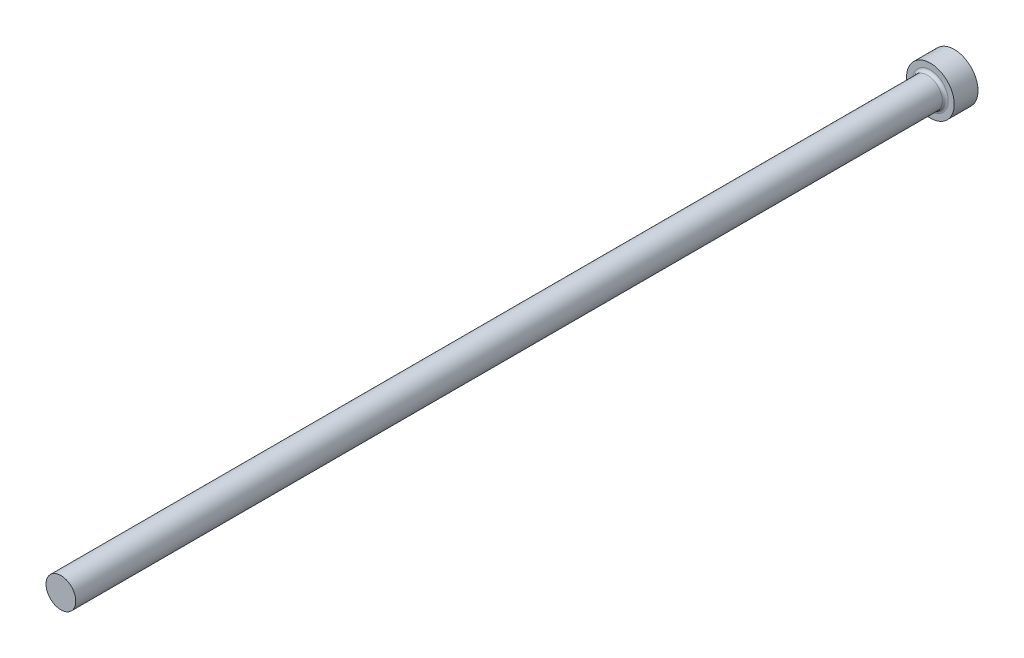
ISO-10303-21;
HEADER;
FILE_DESCRIPTION(('STEP AP214'),'2;1');
FILE_NAME('part.step','',(''),(''),'','','');
FILE_SCHEMA(('AUTOMOTIVE_DESIGN { 1 0 10303 214 1 1 1 1 }'));
ENDSEC;
DATA;
#1=APPLICATION_CONTEXT('core data for automotive mechanical design processes');
#2=APPLICATION_PROTOCOL_DEFINITION('international standard','automotive_design',2000,#1);
#3=PRODUCT_CONTEXT('',#1,'mechanical');
#4=PRODUCT('Part','Part','',(#3));
#5=PRODUCT_RELATED_PRODUCT_CATEGORY('part','',(#4));
#6=PRODUCT_DEFINITION_FORMATION('','',#4);
#7=PRODUCT_DEFINITION_CONTEXT('part definition',#1,'design');
#8=PRODUCT_DEFINITION('design','',#6,#7);
#9=PRODUCT_DEFINITION_SHAPE('','',#8);
#10=(LENGTH_UNIT() NAMED_UNIT(*) SI_UNIT(.MILLI.,.METRE.));
#11=(NAMED_UNIT(*) PLANE_ANGLE_UNIT() SI_UNIT($,.RADIAN.));
#12=(NAMED_UNIT(*) SI_UNIT($,.STERADIAN.) SOLID_ANGLE_UNIT());
#13=UNCERTAINTY_MEASURE_WITH_UNIT(LENGTH_MEASURE(1.E-05),#10,'distance_accuracy_value','');
#14=(GEOMETRIC_REPRESENTATION_CONTEXT(3) GLOBAL_UNCERTAINTY_ASSIGNED_CONTEXT((#13)) GLOBAL_UNIT_ASSIGNED_CONTEXT((#10,
#11,#12)) REPRESENTATION_CONTEXT('',''));
#15=CARTESIAN_POINT('',(0.,0.,0.));
#16=DIRECTION('',(0.,0.,1.));
#17=DIRECTION('',(1.,0.,0.));
#18=AXIS2_PLACEMENT_3D('',#15,#16,#17);
#19=CARTESIAN_POINT('',(4.,0.,4.));
#20=DIRECTION('',(0.,0.,-1.));
#21=DIRECTION('',(-1.,0.,0.));
#22=AXIS2_PLACEMENT_3D('',#19,#20,#21);
#23=PLANE('',#22);
#24=CARTESIAN_POINT('',(0.,0.,4.));
#25=DIRECTION('',(0.,0.,-1.));
#26=DIRECTION('',(-1.,0.,0.));
#27=AXIS2_PLACEMENT_3D('',#24,#25,#26);
#28=CIRCLE('',#27,3.00000000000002);
#29=CARTESIAN_POINT('',(-3.00000000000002,0.,4.));
#30=VERTEX_POINT('',#29);
#31=EDGE_CURVE('E40',#30,#30,#28,.T.);
#32=ORIENTED_EDGE('',*,*,#31,.T.);
#33=EDGE_LOOP('',(#32));
#34=FACE_BOUND('',#33,.T.);
#35=CARTESIAN_POINT('',(0.,0.,4.));
#36=DIRECTION('',(0.,0.,-1.));
#37=DIRECTION('',(-1.,0.,0.));
#38=AXIS2_PLACEMENT_3D('',#35,#36,#37);
#39=CIRCLE('',#38,4.);
#40=CARTESIAN_POINT('',(-4.,0.,4.));
#41=VERTEX_POINT('',#40);
#42=EDGE_CURVE('E44',#41,#41,#39,.T.);
#43=ORIENTED_EDGE('',*,*,#42,.F.);
#44=EDGE_LOOP('',(#43));
#45=FACE_BOUND('',#44,.T.);
#46=ADVANCED_FACE('F33',(#34,#45),#23,.F.);
#47=CARTESIAN_POINT('',(0.,0.,-9.03322817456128));
#48=DIRECTION('',(0.,0.,-1.));
#49=DIRECTION('',(-1.,0.,0.));
#50=AXIS2_PLACEMENT_3D('',#47,#48,#49);
#51=CYLINDRICAL_SURFACE('',#50,4.);
#52=CARTESIAN_POINT('',(0.,0.,0.));
#53=DIRECTION('',(0.,0.,-1.));
#54=DIRECTION('',(-1.,0.,0.));
#55=AXIS2_PLACEMENT_3D('',#52,#53,#54);
#56=CIRCLE('',#55,4.);
#57=CARTESIAN_POINT('',(-4.,0.,0.));
#58=VERTEX_POINT('',#57);
#59=EDGE_CURVE('E48',#58,#58,#56,.T.);
#60=ORIENTED_EDGE('',*,*,#59,.F.);
#61=EDGE_LOOP('',(#60));
#62=FACE_BOUND('',#61,.T.);
#63=ORIENTED_EDGE('',*,*,#42,.T.);
#64=EDGE_LOOP('',(#63));
#65=FACE_BOUND('',#64,.T.);
#66=ADVANCED_FACE('F68',(#62,#65),#51,.T.);
#67=CARTESIAN_POINT('',(0.,0.,0.));
#68=DIRECTION('',(0.,0.,1.));
#69=DIRECTION('',(1.,0.,0.));
#70=AXIS2_PLACEMENT_3D('',#67,#68,#69);
#71=PLANE('',#70);
#72=ORIENTED_EDGE('',*,*,#59,.T.);
#73=EDGE_LOOP('',(#72));
#74=FACE_BOUND('',#73,.T.);
#75=ADVANCED_FACE('F61',(#74),#71,.F.);
#76=CARTESIAN_POINT('',(0.,0.,150.));
#77=DIRECTION('',(0.,0.,-1.));
#78=DIRECTION('',(-1.,0.,0.));
#79=AXIS2_PLACEMENT_3D('',#76,#77,#78);
#80=PLANE('',#79);
#81=CARTESIAN_POINT('',(0.,0.,150.));
#82=DIRECTION('',(0.,0.,-1.));
#83=DIRECTION('',(-1.,0.,0.));
#84=AXIS2_PLACEMENT_3D('',#81,#82,#83);
#85=CIRCLE('',#84,2.50000000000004);
#86=CARTESIAN_POINT('',(-2.50000000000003,0.,150.));
#87=VERTEX_POINT('',#86);
#88=EDGE_CURVE('E53',#87,#87,#85,.T.);
#89=ORIENTED_EDGE('',*,*,#88,.F.);
#90=EDGE_LOOP('',(#89));
#91=FACE_BOUND('',#90,.T.);
#92=ADVANCED_FACE('F59',(#91),#80,.F.);
#93=CARTESIAN_POINT('',(0.,0.,-9.03322817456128));
#94=DIRECTION('',(0.,0.,-1.));
#95=DIRECTION('',(-1.,0.,0.));
#96=AXIS2_PLACEMENT_3D('',#93,#94,#95);
#97=CYLINDRICAL_SURFACE('',#96,2.50000000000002);
#98=CARTESIAN_POINT('',(0.,0.,4.5));
#99=DIRECTION('',(0.,0.,-1.));
#100=DIRECTION('',(-1.,0.,0.));
#101=AXIS2_PLACEMENT_3D('',#98,#99,#100);
#102=CIRCLE('',#101,2.50000000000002);
#103=CARTESIAN_POINT('',(-2.50000000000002,0.,4.5));
#104=VERTEX_POINT('',#103);
#105=EDGE_CURVE('E10',#104,#104,#102,.F.);
#106=ORIENTED_EDGE('',*,*,#105,.T.);
#107=EDGE_LOOP('',(#106));
#108=FACE_BOUND('',#107,.T.);
#109=ORIENTED_EDGE('',*,*,#88,.T.);
#110=EDGE_LOOP('',(#109));
#111=FACE_BOUND('',#110,.T.);
#112=ADVANCED_FACE('F57',(#108,#111),#97,.T.);
#113=CARTESIAN_POINT('',(0.,0.,4.5));
#114=DIRECTION('',(0.,0.,-1.));
#115=DIRECTION('',(-1.,0.,0.));
#116=AXIS2_PLACEMENT_3D('',#113,#114,#115);
#117=TOROIDAL_SURFACE('',#116,3.00000000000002,0.5);
#118=ORIENTED_EDGE('',*,*,#105,.F.);
#119=EDGE_LOOP('',(#118));
#120=FACE_BOUND('',#119,.T.);
#121=ORIENTED_EDGE('',*,*,#31,.F.);
#122=EDGE_LOOP('',(#121));
#123=FACE_BOUND('',#122,.T.);
#124=ADVANCED_FACE('F35',(#120,#123),#117,.F.);
#125=CLOSED_SHELL('',(#46,#66,#75,#92,#112,#124));
#126=MANIFOLD_SOLID_BREP('B2',#125);
#127=ADVANCED_BREP_SHAPE_REPRESENTATION('',(#18,#126),#14);
#128=SHAPE_DEFINITION_REPRESENTATION(#9,#127);
ENDSEC;
END-ISO-10303-21;
